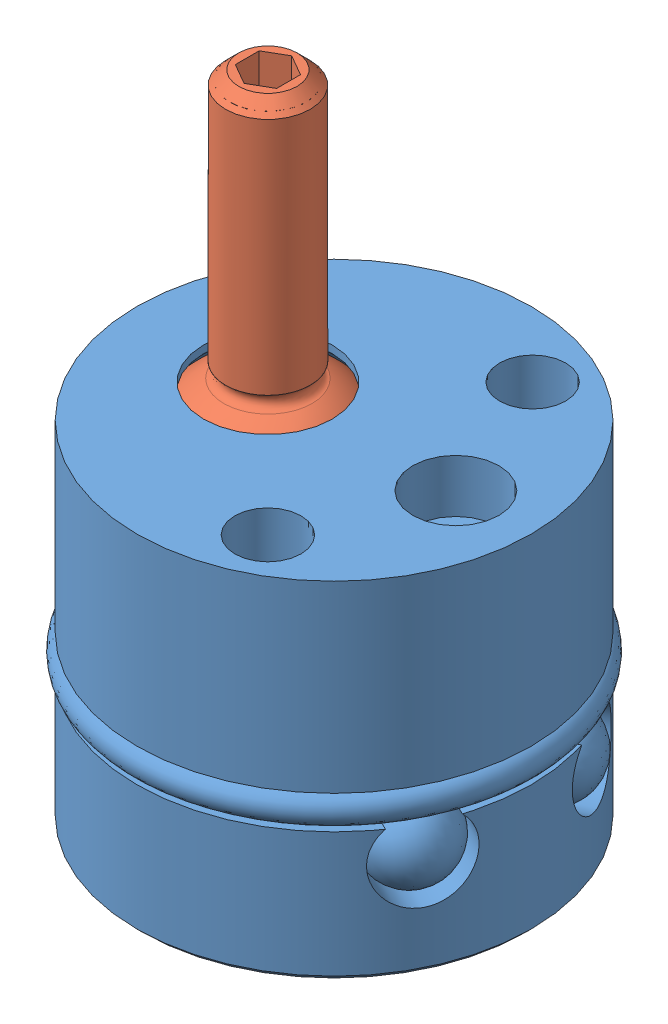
SolidWorks assembly ilc66091204.SLDASM, configuration Default (file format 5000). Lengths in mm.
Overall size (19.58 29.64 19.51).
2 component instances, 2 part files, 0 mates.
Components (placement in the parent):
- ILC66091204_BODY-1: ILC66091204_BODY.sldprt [Default] at origin size (19.58 17.42 19.51)
- ILC66091204_PIVOT-1: ILC66091204_PIVOT.sldprt [Default] at (-3.175 12.6238 0) size (9.22 17.57 9.18)
